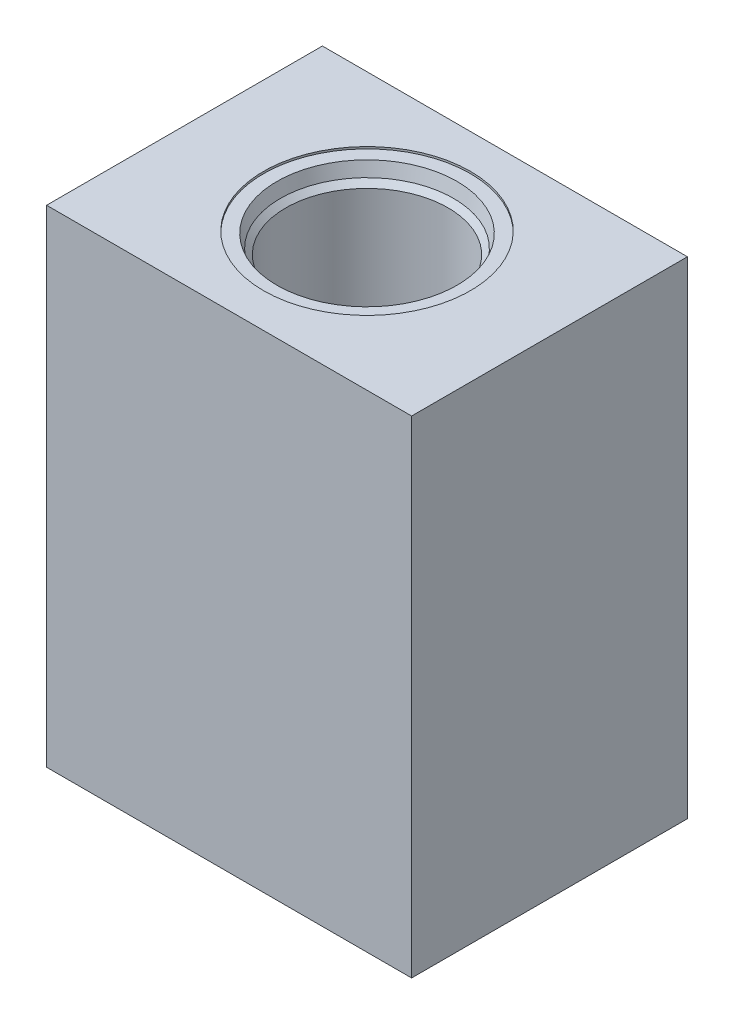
from build123d import *

# Parameters (mm, degrees)
SKIZZE1_W               = 90
SKIZZE1_H               = 68
LINEAR_AUSTRAGEN1_DEPTH = 120


with BuildPart() as part:
    # Skizze1 → Linear austragen1 (new body)
    with BuildSketch(Plane(origin=(0, 0, 0), x_dir=(1, 0, 0), z_dir=(0, 1, 0))):
        Rectangle(SKIZZE1_W, SKIZZE1_H)
    extrude(amount=-LINEAR_AUSTRAGEN1_DEPTH)

    # Skizze3 → Bohrung (revolve, cut)
    with BuildSketch(Plane(origin=(0, 0, 0), x_dir=(0, 0, 1), z_dir=(1, 0, 0))):
        Polygon((0, 0), (0, 109.613769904), (16, 100), (16, 61.701721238), (18, 60.5), (18, 49.994954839), (20, 44.5), (20, 5.042562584), (21.342562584, 3.7), (22.2, 0.5), (25.5, 0.5), (25.5, 0), align=None)
    revolve(axis=Axis((0, 6.35, 0), (0, -1, 0)), mode=Mode.SUBTRACT)


solid = part.part
